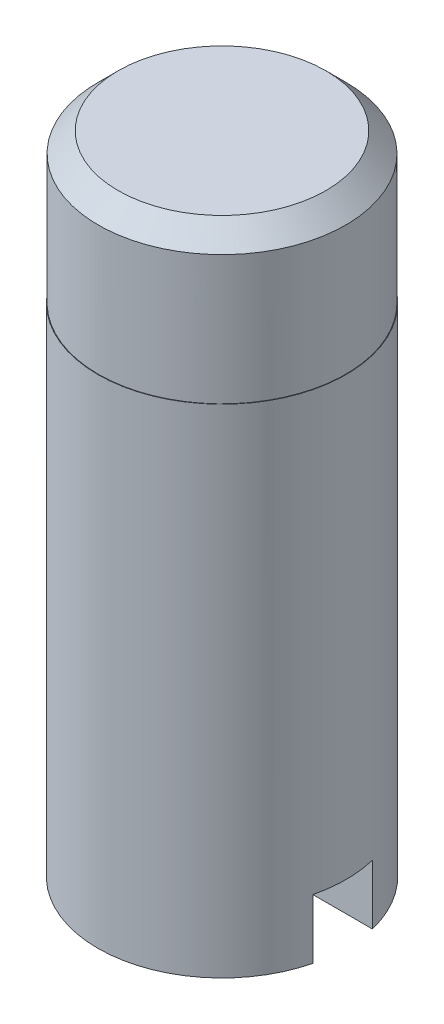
from build123d import *

# Parameters (mm, degrees)
SKETCH1_R          = 2.5
EXTRUDE1_DEPTH     = 10
SKETCH2_R          = 2.49
EXTRUDE2_DEPTH     = 3
SKETCH3_W          = 10.815859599
SKETCH3_H          = 1.2
CUT_EXTRUDE1_DEPTH = 1.2
CHAMFER1_SIZE      = 0.4


with BuildPart() as part:
    # Sketch1 → Extrude1 (new body)
    with BuildSketch(Plane(origin=(0, 0, 0), x_dir=(1, 0, 0), z_dir=(0, 1, 0))):
        with Locations(Location((0, 0, 0), (0, 0, 270))):
            Circle(SKETCH1_R)
    extrude(amount=EXTRUDE1_DEPTH)

    # Sketch2 → Extrude2 (add)
    with BuildSketch(Plane(origin=(0, 10, 0), x_dir=(-1, 0, 0), z_dir=(0, 1, 0))):
        with Locations(Location((0, 0, 0), (0, 0, 90))):
            Circle(SKETCH2_R)
    extrude(amount=EXTRUDE2_DEPTH)

    # Sketch3 → Cut-Extrude1 (cut)
    with BuildSketch(Plane.XZ):
        with Locations((-0.663879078, 0)):
            Rectangle(SKETCH3_W, SKETCH3_H)
    extrude(amount=-CUT_EXTRUDE1_DEPTH, mode=Mode.SUBTRACT)

    # Chamfer1
    chamfer1_edges = [part.edges().sort_by_distance(p)[0] for p in [
        (0, 13, -2.49),
    ]]
    chamfer(chamfer1_edges, length=CHAMFER1_SIZE)


solid = part.part
